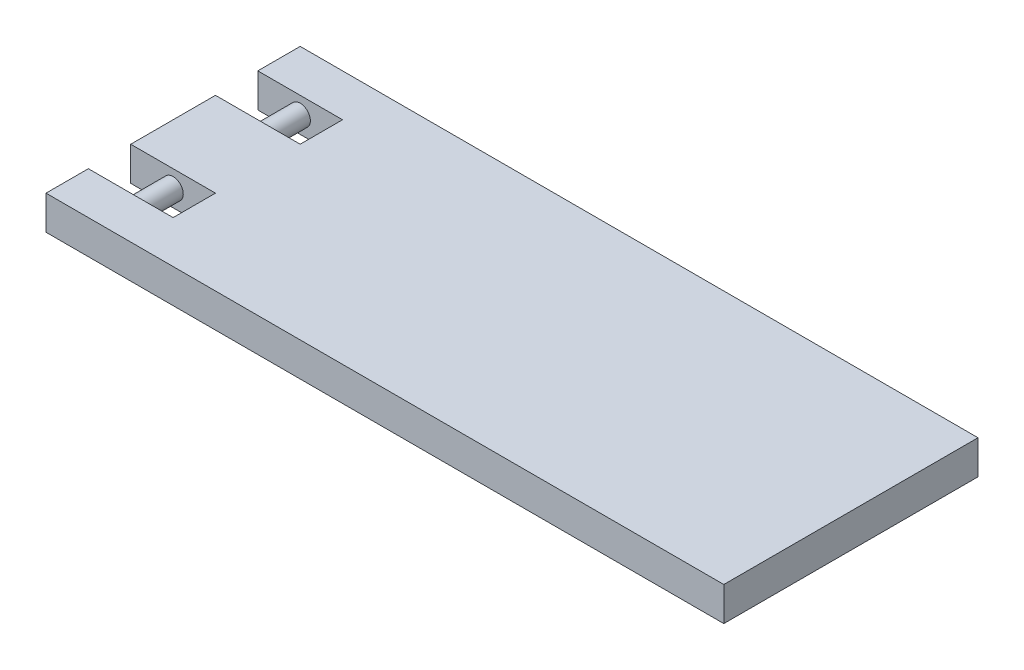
from build123d import *

# Parameters (mm, degrees)
SCHIZZO1_W         = 400
SCHIZZO1_H         = 150
ESTRUSIONE1_DEPTH  = 20
SCHIZZO2_W         = 50
SCHIZZO2_H         = 25
ESTRUSIONE2_DEPTH  = 408.461654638
BOSS_EXTRU_1_REACH = 429.668
SCHIZZO3_R         = 6


with BuildPart() as part:
    # Schizzo1 → Estrusione1 (new body)
    with BuildSketch(Plane(origin=(0, 0, 0), x_dir=(1, 0, 0), z_dir=(0, 1, 0))):
        with Locations((200, 0)):
            Rectangle(SCHIZZO1_W, SCHIZZO1_H)
    extrude(amount=ESTRUSIONE1_DEPTH)

    # Schizzo2 → Estrusione2 (cut, through all)
    with BuildSketch(Plane(origin=(0, 20, 0), x_dir=(1, 0, 0), z_dir=(0, 1, 0))):
        with Locations((25, 37.5)):
            Rectangle(SCHIZZO2_W, SCHIZZO2_H)
    estrusione2 = extrude(amount=-ESTRUSIONE2_DEPTH, mode=Mode.SUBTRACT)

    # Specchia1: Estrusione2 across plane
    add(estrusione2.mirror(Plane.XY), mode=Mode.SUBTRACT)

    # Boss.-Extru.1: up to this face of the body (flat: up to its plane)
    boss_extru_1_end = Plane(part.part.faces().sort_by_distance((200, 10, -75))[0])
    # Schizzo3 → Boss.-Extru.1 (add, up to the picked face)
    with BuildSketch(Plane.XY.offset(75), mode=Mode.PRIVATE) as boss_extru_1_sk1:
        with Locations((25, 10)):
            Circle(SCHIZZO3_R)
    boss_extru_1_tool1 = split(extrude(boss_extru_1_sk1.sketch, amount=-BOSS_EXTRU_1_REACH, mode=Mode.PRIVATE), bisect_by=boss_extru_1_end, keep=Keep.BOTH, mode=Mode.PRIVATE)
    add(boss_extru_1_tool1.solids().sort_by(Axis((25, 10, 75), (0, 0, -1)))[0])


solid = part.part
